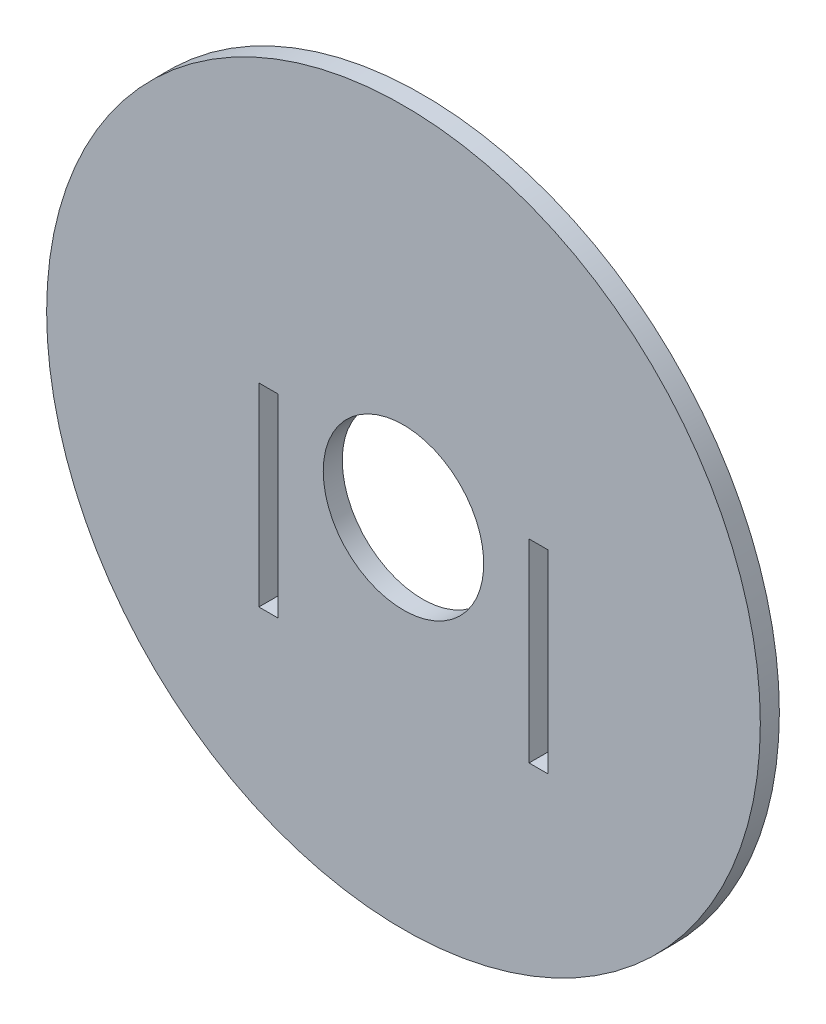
ISO-10303-21;
HEADER;
FILE_DESCRIPTION(('STEP AP214'),'2;1');
FILE_NAME('part.step','',(''),(''),'','','');
FILE_SCHEMA(('AUTOMOTIVE_DESIGN { 1 0 10303 214 1 1 1 1 }'));
ENDSEC;
DATA;
#1=APPLICATION_CONTEXT('core data for automotive mechanical design processes');
#2=APPLICATION_PROTOCOL_DEFINITION('international standard','automotive_design',2000,#1);
#3=PRODUCT_CONTEXT('',#1,'mechanical');
#4=PRODUCT('Part','Part','',(#3));
#5=PRODUCT_RELATED_PRODUCT_CATEGORY('part','',(#4));
#6=PRODUCT_DEFINITION_FORMATION('','',#4);
#7=PRODUCT_DEFINITION_CONTEXT('part definition',#1,'design');
#8=PRODUCT_DEFINITION('design','',#6,#7);
#9=PRODUCT_DEFINITION_SHAPE('','',#8);
#10=(LENGTH_UNIT() NAMED_UNIT(*) SI_UNIT(.MILLI.,.METRE.));
#11=(NAMED_UNIT(*) PLANE_ANGLE_UNIT() SI_UNIT($,.RADIAN.));
#12=(NAMED_UNIT(*) SI_UNIT($,.STERADIAN.) SOLID_ANGLE_UNIT());
#13=UNCERTAINTY_MEASURE_WITH_UNIT(LENGTH_MEASURE(1.E-05),#10,'distance_accuracy_value','');
#14=(GEOMETRIC_REPRESENTATION_CONTEXT(3) GLOBAL_UNCERTAINTY_ASSIGNED_CONTEXT((#13)) GLOBAL_UNIT_ASSIGNED_CONTEXT((#10,
#11,#12)) REPRESENTATION_CONTEXT('',''));
#15=CARTESIAN_POINT('',(0.,0.,0.));
#16=DIRECTION('',(0.,0.,1.));
#17=DIRECTION('',(1.,0.,0.));
#18=AXIS2_PLACEMENT_3D('',#15,#16,#17);
#19=CARTESIAN_POINT('',(59.4530686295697,-177.922739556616,1.524));
#20=DIRECTION('',(0.,0.,1.));
#21=DIRECTION('',(1.,0.,0.));
#22=AXIS2_PLACEMENT_3D('',#19,#20,#21);
#23=PLANE('',#22);
#24=DIRECTION('',(-1.,0.,0.));
#25=VECTOR('',#24,1.);
#26=CARTESIAN_POINT('',(69.5076943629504,-174.380310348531,1.524));
#27=LINE('',#26,#25);
#28=CARTESIAN_POINT('',(71.0316943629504,-174.380310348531,1.524));
#29=VERTEX_POINT('',#28);
#30=CARTESIAN_POINT('',(69.5076943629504,-174.380310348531,1.524));
#31=VERTEX_POINT('',#30);
#32=EDGE_CURVE('E49',#29,#31,#27,.T.);
#33=ORIENTED_EDGE('',*,*,#32,.F.);
#34=DIRECTION('',(0.,1.,0.));
#35=VECTOR('',#34,1.);
#36=CARTESIAN_POINT('',(71.0316943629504,-174.380310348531,1.524));
#37=LINE('',#36,#35);
#38=CARTESIAN_POINT('',(71.0316943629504,-189.916743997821,1.524));
#39=VERTEX_POINT('',#38);
#40=EDGE_CURVE('E117',#39,#29,#37,.T.);
#41=ORIENTED_EDGE('',*,*,#40,.F.);
#42=DIRECTION('',(1.,0.,0.));
#43=VECTOR('',#42,1.);
#44=CARTESIAN_POINT('',(69.5076943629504,-189.916743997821,1.524));
#45=LINE('',#44,#43);
#46=CARTESIAN_POINT('',(69.5076943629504,-189.916743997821,1.524));
#47=VERTEX_POINT('',#46);
#48=EDGE_CURVE('E102',#47,#39,#45,.T.);
#49=ORIENTED_EDGE('',*,*,#48,.F.);
#50=DIRECTION('',(0.,-1.,0.));
#51=VECTOR('',#50,1.);
#52=CARTESIAN_POINT('',(69.5076943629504,-174.380310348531,1.524));
#53=LINE('',#52,#51);
#54=EDGE_CURVE('E111',#31,#47,#53,.T.);
#55=ORIENTED_EDGE('',*,*,#54,.F.);
#56=EDGE_LOOP('',(#33,#41,#49,#55));
#57=FACE_BOUND('',#56,.T.);
#58=DIRECTION('',(0.,1.,0.));
#59=VECTOR('',#58,1.);
#60=CARTESIAN_POINT('',(49.3984428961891,-174.380310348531,1.524));
#61=LINE('',#60,#59);
#62=CARTESIAN_POINT('',(49.3984428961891,-189.916743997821,1.524));
#63=VERTEX_POINT('',#62);
#64=CARTESIAN_POINT('',(49.3984428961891,-174.380310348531,1.524));
#65=VERTEX_POINT('',#64);
#66=EDGE_CURVE('E124',#63,#65,#61,.T.);
#67=ORIENTED_EDGE('',*,*,#66,.F.);
#68=DIRECTION('',(1.,0.,0.));
#69=VECTOR('',#68,1.);
#70=CARTESIAN_POINT('',(49.3984428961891,-189.916743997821,1.524));
#71=LINE('',#70,#69);
#72=CARTESIAN_POINT('',(47.8744428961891,-189.916743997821,1.524));
#73=VERTEX_POINT('',#72);
#74=EDGE_CURVE('E134',#73,#63,#71,.T.);
#75=ORIENTED_EDGE('',*,*,#74,.F.);
#76=DIRECTION('',(0.,-1.,0.));
#77=VECTOR('',#76,1.);
#78=CARTESIAN_POINT('',(47.8744428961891,-174.380310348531,1.524));
#79=LINE('',#78,#77);
#80=CARTESIAN_POINT('',(47.8744428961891,-174.380310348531,1.524));
#81=VERTEX_POINT('',#80);
#82=EDGE_CURVE('E131',#81,#73,#79,.T.);
#83=ORIENTED_EDGE('',*,*,#82,.F.);
#84=DIRECTION('',(-1.,0.,0.));
#85=VECTOR('',#84,1.);
#86=CARTESIAN_POINT('',(49.3984428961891,-174.380310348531,1.524));
#87=LINE('',#86,#85);
#88=EDGE_CURVE('E128',#65,#81,#87,.T.);
#89=ORIENTED_EDGE('',*,*,#88,.F.);
#90=EDGE_LOOP('',(#67,#75,#83,#89));
#91=FACE_BOUND('',#90,.T.);
#92=CARTESIAN_POINT('',(59.4530686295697,-177.922739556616,1.524));
#93=DIRECTION('',(0.,0.,1.));
#94=DIRECTION('',(1.,0.,0.));
#95=AXIS2_PLACEMENT_3D('',#92,#93,#94);
#96=CIRCLE('',#95,28.575);
#97=CARTESIAN_POINT('',(30.8780686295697,-177.922739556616,1.524));
#98=VERTEX_POINT('',#97);
#99=EDGE_CURVE('E153',#98,#98,#96,.T.);
#100=ORIENTED_EDGE('',*,*,#99,.T.);
#101=EDGE_LOOP('',(#100));
#102=FACE_BOUND('',#101,.T.);
#103=CARTESIAN_POINT('',(59.4530686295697,-177.922739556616,1.524));
#104=DIRECTION('',(0.,0.,1.));
#105=DIRECTION('',(1.,0.,0.));
#106=AXIS2_PLACEMENT_3D('',#103,#104,#105);
#107=CIRCLE('',#106,6.4262);
#108=CARTESIAN_POINT('',(53.0268686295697,-177.922739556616,1.524));
#109=VERTEX_POINT('',#108);
#110=EDGE_CURVE('E147',#109,#109,#107,.T.);
#111=ORIENTED_EDGE('',*,*,#110,.F.);
#112=EDGE_LOOP('',(#111));
#113=FACE_BOUND('',#112,.T.);
#114=ADVANCED_FACE('F34',(#57,#91,#102,#113),#23,.T.);
#115=CARTESIAN_POINT('',(59.4530686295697,-177.922739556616,0.));
#116=DIRECTION('',(0.,0.,1.));
#117=DIRECTION('',(1.,0.,0.));
#118=AXIS2_PLACEMENT_3D('',#115,#116,#117);
#119=PLANE('',#118);
#120=DIRECTION('',(0.,1.,0.));
#121=VECTOR('',#120,1.);
#122=CARTESIAN_POINT('',(71.0316943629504,-177.922739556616,0.));
#123=LINE('',#122,#121);
#124=CARTESIAN_POINT('',(71.0316943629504,-189.916743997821,0.));
#125=VERTEX_POINT('',#124);
#126=CARTESIAN_POINT('',(71.0316943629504,-174.380310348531,0.));
#127=VERTEX_POINT('',#126);
#128=EDGE_CURVE('E42',#125,#127,#123,.T.);
#129=ORIENTED_EDGE('',*,*,#128,.T.);
#130=DIRECTION('',(-1.,0.,0.));
#131=VECTOR('',#130,1.);
#132=CARTESIAN_POINT('',(59.4530686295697,-174.380310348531,0.));
#133=LINE('',#132,#131);
#134=CARTESIAN_POINT('',(69.5076943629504,-174.380310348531,0.));
#135=VERTEX_POINT('',#134);
#136=EDGE_CURVE('E11',#127,#135,#133,.T.);
#137=ORIENTED_EDGE('',*,*,#136,.T.);
#138=DIRECTION('',(0.,-1.,0.));
#139=VECTOR('',#138,1.);
#140=CARTESIAN_POINT('',(69.5076943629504,-177.922739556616,0.));
#141=LINE('',#140,#139);
#142=CARTESIAN_POINT('',(69.5076943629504,-189.916743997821,0.));
#143=VERTEX_POINT('',#142);
#144=EDGE_CURVE('E170',#135,#143,#141,.T.);
#145=ORIENTED_EDGE('',*,*,#144,.T.);
#146=DIRECTION('',(1.,0.,0.));
#147=VECTOR('',#146,1.);
#148=CARTESIAN_POINT('',(59.4530686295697,-189.916743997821,0.));
#149=LINE('',#148,#147);
#150=EDGE_CURVE('E105',#143,#125,#149,.T.);
#151=ORIENTED_EDGE('',*,*,#150,.T.);
#152=EDGE_LOOP('',(#129,#137,#145,#151));
#153=FACE_BOUND('',#152,.T.);
#154=DIRECTION('',(1.,0.,0.));
#155=VECTOR('',#154,1.);
#156=CARTESIAN_POINT('',(59.4530686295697,-189.916743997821,0.));
#157=LINE('',#156,#155);
#158=CARTESIAN_POINT('',(47.8744428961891,-189.916743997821,0.));
#159=VERTEX_POINT('',#158);
#160=CARTESIAN_POINT('',(49.3984428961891,-189.916743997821,0.));
#161=VERTEX_POINT('',#160);
#162=EDGE_CURVE('E164',#159,#161,#157,.T.);
#163=ORIENTED_EDGE('',*,*,#162,.T.);
#164=DIRECTION('',(0.,1.,0.));
#165=VECTOR('',#164,1.);
#166=CARTESIAN_POINT('',(49.3984428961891,-177.922739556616,0.));
#167=LINE('',#166,#165);
#168=CARTESIAN_POINT('',(49.3984428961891,-174.380310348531,0.));
#169=VERTEX_POINT('',#168);
#170=EDGE_CURVE('E167',#161,#169,#167,.T.);
#171=ORIENTED_EDGE('',*,*,#170,.T.);
#172=DIRECTION('',(-1.,0.,0.));
#173=VECTOR('',#172,1.);
#174=CARTESIAN_POINT('',(59.4530686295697,-174.380310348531,0.));
#175=LINE('',#174,#173);
#176=CARTESIAN_POINT('',(47.8744428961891,-174.380310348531,0.));
#177=VERTEX_POINT('',#176);
#178=EDGE_CURVE('E156',#169,#177,#175,.T.);
#179=ORIENTED_EDGE('',*,*,#178,.T.);
#180=DIRECTION('',(0.,-1.,0.));
#181=VECTOR('',#180,1.);
#182=CARTESIAN_POINT('',(47.8744428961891,-177.922739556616,0.));
#183=LINE('',#182,#181);
#184=EDGE_CURVE('E161',#177,#159,#183,.T.);
#185=ORIENTED_EDGE('',*,*,#184,.T.);
#186=EDGE_LOOP('',(#163,#171,#179,#185));
#187=FACE_BOUND('',#186,.T.);
#188=CARTESIAN_POINT('',(59.4530686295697,-177.922739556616,0.));
#189=DIRECTION('',(0.,0.,1.));
#190=DIRECTION('',(1.,0.,0.));
#191=AXIS2_PLACEMENT_3D('',#188,#189,#190);
#192=CIRCLE('',#191,28.575);
#193=CARTESIAN_POINT('',(30.8780686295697,-177.922739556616,0.));
#194=VERTEX_POINT('',#193);
#195=EDGE_CURVE('E150',#194,#194,#192,.T.);
#196=ORIENTED_EDGE('',*,*,#195,.F.);
#197=EDGE_LOOP('',(#196));
#198=FACE_BOUND('',#197,.T.);
#199=CARTESIAN_POINT('',(59.4530686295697,-177.922739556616,0.));
#200=DIRECTION('',(0.,0.,1.));
#201=DIRECTION('',(1.,0.,0.));
#202=AXIS2_PLACEMENT_3D('',#199,#200,#201);
#203=CIRCLE('',#202,6.4262);
#204=CARTESIAN_POINT('',(53.0268686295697,-177.922739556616,0.));
#205=VERTEX_POINT('',#204);
#206=EDGE_CURVE('E140',#205,#205,#203,.T.);
#207=ORIENTED_EDGE('',*,*,#206,.T.);
#208=EDGE_LOOP('',(#207));
#209=FACE_BOUND('',#208,.T.);
#210=ADVANCED_FACE('F174',(#153,#187,#198,#209),#119,.F.);
#211=CARTESIAN_POINT('',(59.4530686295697,-177.922739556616,1.524));
#212=DIRECTION('',(0.,0.,-1.));
#213=DIRECTION('',(-1.,0.,0.));
#214=AXIS2_PLACEMENT_3D('',#211,#212,#213);
#215=CYLINDRICAL_SURFACE('',#214,28.575);
#216=CARTESIAN_POINT('',(30.8780686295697,-177.922739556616,1.524));
#217=CARTESIAN_POINT('',(30.8780686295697,-177.922739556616,1.508125));
#218=CARTESIAN_POINT('',(30.8780686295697,-177.922739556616,1.49225));
#219=CARTESIAN_POINT('',(30.8780686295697,-177.922739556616,1.4605));
#220=CARTESIAN_POINT('',(30.8780686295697,-177.922739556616,1.444625));
#221=CARTESIAN_POINT('',(30.8780686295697,-177.922739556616,1.412875));
#222=CARTESIAN_POINT('',(30.8780686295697,-177.922739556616,1.397));
#223=CARTESIAN_POINT('',(30.8780686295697,-177.922739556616,1.36525));
#224=CARTESIAN_POINT('',(30.8780686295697,-177.922739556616,1.349375));
#225=CARTESIAN_POINT('',(30.8780686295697,-177.922739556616,1.317625));
#226=CARTESIAN_POINT('',(30.8780686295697,-177.922739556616,1.30175));
#227=CARTESIAN_POINT('',(30.8780686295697,-177.922739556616,1.27));
#228=CARTESIAN_POINT('',(30.8780686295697,-177.922739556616,1.254125));
#229=CARTESIAN_POINT('',(30.8780686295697,-177.922739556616,1.222375));
#230=CARTESIAN_POINT('',(30.8780686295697,-177.922739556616,1.2065));
#231=CARTESIAN_POINT('',(30.8780686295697,-177.922739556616,1.17475));
#232=CARTESIAN_POINT('',(30.8780686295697,-177.922739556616,1.158875));
#233=CARTESIAN_POINT('',(30.8780686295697,-177.922739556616,1.127125));
#234=CARTESIAN_POINT('',(30.8780686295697,-177.922739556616,1.11125));
#235=CARTESIAN_POINT('',(30.8780686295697,-177.922739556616,1.0795));
#236=CARTESIAN_POINT('',(30.8780686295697,-177.922739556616,1.063625));
#237=CARTESIAN_POINT('',(30.8780686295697,-177.922739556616,1.031875));
#238=CARTESIAN_POINT('',(30.8780686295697,-177.922739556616,1.016));
#239=CARTESIAN_POINT('',(30.8780686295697,-177.922739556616,0.98425));
#240=CARTESIAN_POINT('',(30.8780686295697,-177.922739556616,0.968375));
#241=CARTESIAN_POINT('',(30.8780686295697,-177.922739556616,0.936625));
#242=CARTESIAN_POINT('',(30.8780686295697,-177.922739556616,0.92075));
#243=CARTESIAN_POINT('',(30.8780686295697,-177.922739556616,0.889));
#244=CARTESIAN_POINT('',(30.8780686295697,-177.922739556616,0.873125));
#245=CARTESIAN_POINT('',(30.8780686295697,-177.922739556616,0.841375));
#246=CARTESIAN_POINT('',(30.8780686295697,-177.922739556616,0.8255));
#247=CARTESIAN_POINT('',(30.8780686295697,-177.922739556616,0.79375));
#248=CARTESIAN_POINT('',(30.8780686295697,-177.922739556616,0.777875));
#249=CARTESIAN_POINT('',(30.8780686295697,-177.922739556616,0.746125));
#250=CARTESIAN_POINT('',(30.8780686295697,-177.922739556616,0.73025));
#251=CARTESIAN_POINT('',(30.8780686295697,-177.922739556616,0.6985));
#252=CARTESIAN_POINT('',(30.8780686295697,-177.922739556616,0.682625));
#253=CARTESIAN_POINT('',(30.8780686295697,-177.922739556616,0.650875));
#254=CARTESIAN_POINT('',(30.8780686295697,-177.922739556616,0.635));
#255=CARTESIAN_POINT('',(30.8780686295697,-177.922739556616,0.60325));
#256=CARTESIAN_POINT('',(30.8780686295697,-177.922739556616,0.587375));
#257=CARTESIAN_POINT('',(30.8780686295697,-177.922739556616,0.555625));
#258=CARTESIAN_POINT('',(30.8780686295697,-177.922739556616,0.53975));
#259=CARTESIAN_POINT('',(30.8780686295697,-177.922739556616,0.508));
#260=CARTESIAN_POINT('',(30.8780686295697,-177.922739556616,0.492125));
#261=CARTESIAN_POINT('',(30.8780686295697,-177.922739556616,0.460375));
#262=CARTESIAN_POINT('',(30.8780686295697,-177.922739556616,0.4445));
#263=CARTESIAN_POINT('',(30.8780686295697,-177.922739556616,0.41275));
#264=CARTESIAN_POINT('',(30.8780686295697,-177.922739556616,0.396875));
#265=CARTESIAN_POINT('',(30.8780686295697,-177.922739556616,0.365125));
#266=CARTESIAN_POINT('',(30.8780686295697,-177.922739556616,0.34925));
#267=CARTESIAN_POINT('',(30.8780686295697,-177.922739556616,0.3175));
#268=CARTESIAN_POINT('',(30.8780686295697,-177.922739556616,0.301625));
#269=CARTESIAN_POINT('',(30.8780686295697,-177.922739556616,0.269875));
#270=CARTESIAN_POINT('',(30.8780686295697,-177.922739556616,0.254));
#271=CARTESIAN_POINT('',(30.8780686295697,-177.922739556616,0.22225));
#272=CARTESIAN_POINT('',(30.8780686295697,-177.922739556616,0.206375));
#273=CARTESIAN_POINT('',(30.8780686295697,-177.922739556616,0.174625));
#274=CARTESIAN_POINT('',(30.8780686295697,-177.922739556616,0.15875));
#275=CARTESIAN_POINT('',(30.8780686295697,-177.922739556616,0.127));
#276=CARTESIAN_POINT('',(30.8780686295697,-177.922739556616,0.111125));
#277=CARTESIAN_POINT('',(30.8780686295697,-177.922739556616,0.079375));
#278=CARTESIAN_POINT('',(30.8780686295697,-177.922739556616,0.0635));
#279=CARTESIAN_POINT('',(30.8780686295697,-177.922739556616,0.0317499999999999));
#280=CARTESIAN_POINT('',(30.8780686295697,-177.922739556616,0.015875));
#281=CARTESIAN_POINT('',(30.8780686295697,-177.922739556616,0.));
#282=B_SPLINE_CURVE_WITH_KNOTS('',3,(#216,#217,#218,#219,#220,#221,#222,#223,#224,#225,#226,
#227,#228,#229,#230,#231,#232,#233,#234,#235,#236,#237,#238,#239,#240,#241,#242,#243,#244,#245,
#246,#247,#248,#249,#250,#251,#252,#253,#254,#255,#256,#257,#258,#259,#260,#261,#262,#263,#264,
#265,#266,#267,#268,#269,#270,#271,#272,#273,#274,#275,#276,#277,#278,#279,#280,#281),
.UNSPECIFIED.,.F.,.F.,(4,2,2,2,2,2,2,2,2,2,2,2,2,2,2,2,2,2,2,2,2,2,2,2,2,2,2,2,2,2,2,2,4),(0.,
0.0476249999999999,0.0952499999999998,0.142875,0.1905,0.238125,0.28575,0.333375,0.381,0.428625,
0.47625,0.523875,0.5715,0.619125,0.66675,0.714375,0.762,0.809625,0.85725,0.904875,0.9525,
1.000125,1.04775,1.095375,1.143,1.190625,1.23825,1.285875,1.3335,1.381125,1.42875,1.476375,
1.524),.UNSPECIFIED.);
#283=EDGE_CURVE('BSEAM36',#98,#194,#282,.T.);
#284=ORIENTED_EDGE('',*,*,#99,.F.);
#285=ORIENTED_EDGE('',*,*,#195,.T.);
#286=ORIENTED_EDGE('',*,*,#283,.T.);
#287=ORIENTED_EDGE('',*,*,#283,.F.);
#288=EDGE_LOOP('',(#284,#286,#285,#287));
#289=FACE_BOUND('',#288,.T.);
#290=ADVANCED_FACE('F36',(#289),#215,.T.);
#291=CARTESIAN_POINT('',(59.4530686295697,-177.922739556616,1.524));
#292=DIRECTION('',(0.,0.,-1.));
#293=DIRECTION('',(-1.,0.,0.));
#294=AXIS2_PLACEMENT_3D('',#291,#292,#293);
#295=CYLINDRICAL_SURFACE('',#294,6.4262);
#296=CARTESIAN_POINT('',(53.0268686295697,-177.922739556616,1.524));
#297=CARTESIAN_POINT('',(53.0268686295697,-177.922739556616,1.508125));
#298=CARTESIAN_POINT('',(53.0268686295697,-177.922739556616,1.49225));
#299=CARTESIAN_POINT('',(53.0268686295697,-177.922739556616,1.4605));
#300=CARTESIAN_POINT('',(53.0268686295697,-177.922739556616,1.444625));
#301=CARTESIAN_POINT('',(53.0268686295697,-177.922739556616,1.412875));
#302=CARTESIAN_POINT('',(53.0268686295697,-177.922739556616,1.397));
#303=CARTESIAN_POINT('',(53.0268686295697,-177.922739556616,1.36525));
#304=CARTESIAN_POINT('',(53.0268686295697,-177.922739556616,1.349375));
#305=CARTESIAN_POINT('',(53.0268686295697,-177.922739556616,1.317625));
#306=CARTESIAN_POINT('',(53.0268686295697,-177.922739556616,1.30175));
#307=CARTESIAN_POINT('',(53.0268686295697,-177.922739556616,1.27));
#308=CARTESIAN_POINT('',(53.0268686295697,-177.922739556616,1.254125));
#309=CARTESIAN_POINT('',(53.0268686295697,-177.922739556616,1.222375));
#310=CARTESIAN_POINT('',(53.0268686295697,-177.922739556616,1.2065));
#311=CARTESIAN_POINT('',(53.0268686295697,-177.922739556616,1.17475));
#312=CARTESIAN_POINT('',(53.0268686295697,-177.922739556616,1.158875));
#313=CARTESIAN_POINT('',(53.0268686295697,-177.922739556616,1.127125));
#314=CARTESIAN_POINT('',(53.0268686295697,-177.922739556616,1.11125));
#315=CARTESIAN_POINT('',(53.0268686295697,-177.922739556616,1.0795));
#316=CARTESIAN_POINT('',(53.0268686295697,-177.922739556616,1.063625));
#317=CARTESIAN_POINT('',(53.0268686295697,-177.922739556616,1.031875));
#318=CARTESIAN_POINT('',(53.0268686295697,-177.922739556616,1.016));
#319=CARTESIAN_POINT('',(53.0268686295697,-177.922739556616,0.98425));
#320=CARTESIAN_POINT('',(53.0268686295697,-177.922739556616,0.968375));
#321=CARTESIAN_POINT('',(53.0268686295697,-177.922739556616,0.936625));
#322=CARTESIAN_POINT('',(53.0268686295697,-177.922739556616,0.92075));
#323=CARTESIAN_POINT('',(53.0268686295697,-177.922739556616,0.889));
#324=CARTESIAN_POINT('',(53.0268686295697,-177.922739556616,0.873125));
#325=CARTESIAN_POINT('',(53.0268686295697,-177.922739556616,0.841375));
#326=CARTESIAN_POINT('',(53.0268686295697,-177.922739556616,0.8255));
#327=CARTESIAN_POINT('',(53.0268686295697,-177.922739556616,0.79375));
#328=CARTESIAN_POINT('',(53.0268686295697,-177.922739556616,0.777875));
#329=CARTESIAN_POINT('',(53.0268686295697,-177.922739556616,0.746125));
#330=CARTESIAN_POINT('',(53.0268686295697,-177.922739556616,0.73025));
#331=CARTESIAN_POINT('',(53.0268686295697,-177.922739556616,0.6985));
#332=CARTESIAN_POINT('',(53.0268686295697,-177.922739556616,0.682625));
#333=CARTESIAN_POINT('',(53.0268686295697,-177.922739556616,0.650875));
#334=CARTESIAN_POINT('',(53.0268686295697,-177.922739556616,0.635));
#335=CARTESIAN_POINT('',(53.0268686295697,-177.922739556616,0.60325));
#336=CARTESIAN_POINT('',(53.0268686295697,-177.922739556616,0.587375));
#337=CARTESIAN_POINT('',(53.0268686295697,-177.922739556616,0.555625));
#338=CARTESIAN_POINT('',(53.0268686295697,-177.922739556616,0.53975));
#339=CARTESIAN_POINT('',(53.0268686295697,-177.922739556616,0.508));
#340=CARTESIAN_POINT('',(53.0268686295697,-177.922739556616,0.492125));
#341=CARTESIAN_POINT('',(53.0268686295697,-177.922739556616,0.460375));
#342=CARTESIAN_POINT('',(53.0268686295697,-177.922739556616,0.4445));
#343=CARTESIAN_POINT('',(53.0268686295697,-177.922739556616,0.41275));
#344=CARTESIAN_POINT('',(53.0268686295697,-177.922739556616,0.396875));
#345=CARTESIAN_POINT('',(53.0268686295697,-177.922739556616,0.365125));
#346=CARTESIAN_POINT('',(53.0268686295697,-177.922739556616,0.34925));
#347=CARTESIAN_POINT('',(53.0268686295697,-177.922739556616,0.3175));
#348=CARTESIAN_POINT('',(53.0268686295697,-177.922739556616,0.301625));
#349=CARTESIAN_POINT('',(53.0268686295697,-177.922739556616,0.269875));
#350=CARTESIAN_POINT('',(53.0268686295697,-177.922739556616,0.254));
#351=CARTESIAN_POINT('',(53.0268686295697,-177.922739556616,0.22225));
#352=CARTESIAN_POINT('',(53.0268686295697,-177.922739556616,0.206375));
#353=CARTESIAN_POINT('',(53.0268686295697,-177.922739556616,0.174625));
#354=CARTESIAN_POINT('',(53.0268686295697,-177.922739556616,0.15875));
#355=CARTESIAN_POINT('',(53.0268686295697,-177.922739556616,0.127));
#356=CARTESIAN_POINT('',(53.0268686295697,-177.922739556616,0.111125));
#357=CARTESIAN_POINT('',(53.0268686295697,-177.922739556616,0.079375));
#358=CARTESIAN_POINT('',(53.0268686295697,-177.922739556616,0.0635));
#359=CARTESIAN_POINT('',(53.0268686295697,-177.922739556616,0.0317499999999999));
#360=CARTESIAN_POINT('',(53.0268686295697,-177.922739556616,0.015875));
#361=CARTESIAN_POINT('',(53.0268686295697,-177.922739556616,0.));
#362=B_SPLINE_CURVE_WITH_KNOTS('',3,(#296,#297,#298,#299,#300,#301,#302,#303,#304,#305,#306,
#307,#308,#309,#310,#311,#312,#313,#314,#315,#316,#317,#318,#319,#320,#321,#322,#323,#324,#325,
#326,#327,#328,#329,#330,#331,#332,#333,#334,#335,#336,#337,#338,#339,#340,#341,#342,#343,#344,
#345,#346,#347,#348,#349,#350,#351,#352,#353,#354,#355,#356,#357,#358,#359,#360,#361),
.UNSPECIFIED.,.F.,.F.,(4,2,2,2,2,2,2,2,2,2,2,2,2,2,2,2,2,2,2,2,2,2,2,2,2,2,2,2,2,2,2,2,4),(0.,
0.0476249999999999,0.0952499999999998,0.142875,0.1905,0.238125,0.28575,0.333375,0.381,0.428625,
0.47625,0.523875,0.5715,0.619125,0.66675,0.714375,0.762,0.809625,0.85725,0.904875,0.9525,
1.000125,1.04775,1.095375,1.143,1.190625,1.23825,1.285875,1.3335,1.381125,1.42875,1.476375,
1.524),.UNSPECIFIED.);
#363=EDGE_CURVE('BSEAM199',#109,#205,#362,.T.);
#364=ORIENTED_EDGE('',*,*,#110,.T.);
#365=ORIENTED_EDGE('',*,*,#206,.F.);
#366=ORIENTED_EDGE('',*,*,#363,.T.);
#367=ORIENTED_EDGE('',*,*,#363,.F.);
#368=EDGE_LOOP('',(#364,#366,#365,#367));
#369=FACE_BOUND('',#368,.T.);
#370=ADVANCED_FACE('F199',(#369),#295,.F.);
#371=CARTESIAN_POINT('',(49.3984428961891,-174.380310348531,-1.016));
#372=DIRECTION('',(1.,0.,0.));
#373=DIRECTION('',(0.,0.,-1.));
#374=AXIS2_PLACEMENT_3D('',#371,#372,#373);
#375=PLANE('',#374);
#376=DIRECTION('',(0.,0.,1.));
#377=VECTOR('',#376,1.);
#378=CARTESIAN_POINT('',(49.3984428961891,-189.916743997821,-1.016));
#379=LINE('',#378,#377);
#380=EDGE_CURVE('E138',#161,#63,#379,.T.);
#381=ORIENTED_EDGE('',*,*,#380,.T.);
#382=ORIENTED_EDGE('',*,*,#66,.T.);
#383=DIRECTION('',(0.,0.,1.));
#384=VECTOR('',#383,1.);
#385=CARTESIAN_POINT('',(49.3984428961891,-174.380310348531,-1.016));
#386=LINE('',#385,#384);
#387=EDGE_CURVE('E137',#169,#65,#386,.T.);
#388=ORIENTED_EDGE('',*,*,#387,.F.);
#389=ORIENTED_EDGE('',*,*,#170,.F.);
#390=EDGE_LOOP('',(#381,#382,#388,#389));
#391=FACE_BOUND('',#390,.T.);
#392=ADVANCED_FACE('F202',(#391),#375,.F.);
#393=CARTESIAN_POINT('',(49.3984428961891,-189.916743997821,-1.016));
#394=DIRECTION('',(0.,-1.,0.));
#395=DIRECTION('',(0.,0.,-1.));
#396=AXIS2_PLACEMENT_3D('',#393,#394,#395);
#397=PLANE('',#396);
#398=DIRECTION('',(0.,0.,1.));
#399=VECTOR('',#398,1.);
#400=CARTESIAN_POINT('',(47.8744428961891,-189.916743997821,-1.016));
#401=LINE('',#400,#399);
#402=EDGE_CURVE('E141',#159,#73,#401,.T.);
#403=ORIENTED_EDGE('',*,*,#402,.T.);
#404=ORIENTED_EDGE('',*,*,#74,.T.);
#405=ORIENTED_EDGE('',*,*,#380,.F.);
#406=ORIENTED_EDGE('',*,*,#162,.F.);
#407=EDGE_LOOP('',(#403,#404,#405,#406));
#408=FACE_BOUND('',#407,.T.);
#409=ADVANCED_FACE('F205',(#408),#397,.F.);
#410=CARTESIAN_POINT('',(47.8744428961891,-174.380310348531,-1.016));
#411=DIRECTION('',(-1.,0.,0.));
#412=DIRECTION('',(0.,0.,1.));
#413=AXIS2_PLACEMENT_3D('',#410,#411,#412);
#414=PLANE('',#413);
#415=DIRECTION('',(0.,0.,1.));
#416=VECTOR('',#415,1.);
#417=CARTESIAN_POINT('',(47.8744428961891,-174.380310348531,-1.016));
#418=LINE('',#417,#416);
#419=EDGE_CURVE('E143',#177,#81,#418,.T.);
#420=ORIENTED_EDGE('',*,*,#419,.T.);
#421=ORIENTED_EDGE('',*,*,#82,.T.);
#422=ORIENTED_EDGE('',*,*,#402,.F.);
#423=ORIENTED_EDGE('',*,*,#184,.F.);
#424=EDGE_LOOP('',(#420,#421,#422,#423));
#425=FACE_BOUND('',#424,.T.);
#426=ADVANCED_FACE('F188',(#425),#414,.F.);
#427=CARTESIAN_POINT('',(49.3984428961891,-174.380310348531,-1.016));
#428=DIRECTION('',(0.,1.,0.));
#429=DIRECTION('',(0.,0.,1.));
#430=AXIS2_PLACEMENT_3D('',#427,#428,#429);
#431=PLANE('',#430);
#432=ORIENTED_EDGE('',*,*,#387,.T.);
#433=ORIENTED_EDGE('',*,*,#88,.T.);
#434=ORIENTED_EDGE('',*,*,#419,.F.);
#435=ORIENTED_EDGE('',*,*,#178,.F.);
#436=EDGE_LOOP('',(#432,#433,#434,#435));
#437=FACE_BOUND('',#436,.T.);
#438=ADVANCED_FACE('F181',(#437),#431,.F.);
#439=CARTESIAN_POINT('',(69.5076943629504,-174.380310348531,-1.016));
#440=DIRECTION('',(0.,1.,0.));
#441=DIRECTION('',(0.,0.,1.));
#442=AXIS2_PLACEMENT_3D('',#439,#440,#441);
#443=PLANE('',#442);
#444=DIRECTION('',(0.,0.,1.));
#445=VECTOR('',#444,1.);
#446=CARTESIAN_POINT('',(71.0316943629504,-174.380310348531,-1.016));
#447=LINE('',#446,#445);
#448=EDGE_CURVE('E122',#127,#29,#447,.T.);
#449=ORIENTED_EDGE('',*,*,#448,.T.);
#450=ORIENTED_EDGE('',*,*,#32,.T.);
#451=DIRECTION('',(0.,0.,1.));
#452=VECTOR('',#451,1.);
#453=CARTESIAN_POINT('',(69.5076943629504,-174.380310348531,-1.016));
#454=LINE('',#453,#452);
#455=EDGE_CURVE('E108',#135,#31,#454,.T.);
#456=ORIENTED_EDGE('',*,*,#455,.F.);
#457=ORIENTED_EDGE('',*,*,#136,.F.);
#458=EDGE_LOOP('',(#449,#450,#456,#457));
#459=FACE_BOUND('',#458,.T.);
#460=ADVANCED_FACE('F179',(#459),#443,.F.);
#461=CARTESIAN_POINT('',(71.0316943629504,-174.380310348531,-1.016));
#462=DIRECTION('',(1.,0.,0.));
#463=DIRECTION('',(0.,0.,-1.));
#464=AXIS2_PLACEMENT_3D('',#461,#462,#463);
#465=PLANE('',#464);
#466=DIRECTION('',(0.,0.,1.));
#467=VECTOR('',#466,1.);
#468=CARTESIAN_POINT('',(71.0316943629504,-189.916743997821,-1.016));
#469=LINE('',#468,#467);
#470=EDGE_CURVE('E107',#125,#39,#469,.T.);
#471=ORIENTED_EDGE('',*,*,#470,.T.);
#472=ORIENTED_EDGE('',*,*,#40,.T.);
#473=ORIENTED_EDGE('',*,*,#448,.F.);
#474=ORIENTED_EDGE('',*,*,#128,.F.);
#475=EDGE_LOOP('',(#471,#472,#473,#474));
#476=FACE_BOUND('',#475,.T.);
#477=ADVANCED_FACE('F178',(#476),#465,.F.);
#478=CARTESIAN_POINT('',(69.5076943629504,-189.916743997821,-1.016));
#479=DIRECTION('',(0.,-1.,0.));
#480=DIRECTION('',(0.,0.,-1.));
#481=AXIS2_PLACEMENT_3D('',#478,#479,#480);
#482=PLANE('',#481);
#483=DIRECTION('',(0.,0.,1.));
#484=VECTOR('',#483,1.);
#485=CARTESIAN_POINT('',(69.5076943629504,-189.916743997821,-1.016));
#486=LINE('',#485,#484);
#487=EDGE_CURVE('E57',#143,#47,#486,.T.);
#488=ORIENTED_EDGE('',*,*,#487,.T.);
#489=ORIENTED_EDGE('',*,*,#48,.T.);
#490=ORIENTED_EDGE('',*,*,#470,.F.);
#491=ORIENTED_EDGE('',*,*,#150,.F.);
#492=EDGE_LOOP('',(#488,#489,#490,#491));
#493=FACE_BOUND('',#492,.T.);
#494=ADVANCED_FACE('F99',(#493),#482,.F.);
#495=CARTESIAN_POINT('',(69.5076943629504,-174.380310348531,-1.016));
#496=DIRECTION('',(-1.,0.,0.));
#497=DIRECTION('',(0.,0.,1.));
#498=AXIS2_PLACEMENT_3D('',#495,#496,#497);
#499=PLANE('',#498);
#500=ORIENTED_EDGE('',*,*,#455,.T.);
#501=ORIENTED_EDGE('',*,*,#54,.T.);
#502=ORIENTED_EDGE('',*,*,#487,.F.);
#503=ORIENTED_EDGE('',*,*,#144,.F.);
#504=EDGE_LOOP('',(#500,#501,#502,#503));
#505=FACE_BOUND('',#504,.T.);
#506=ADVANCED_FACE('F112',(#505),#499,.F.);
#507=CLOSED_SHELL('',(#114,#210,#290,#370,#392,#409,#426,#438,#460,#477,#494,#506));
#508=MANIFOLD_SOLID_BREP('B2',#507);
#509=ADVANCED_BREP_SHAPE_REPRESENTATION('',(#18,#508),#14);
#510=SHAPE_DEFINITION_REPRESENTATION(#9,#509);
ENDSEC;
END-ISO-10303-21;
